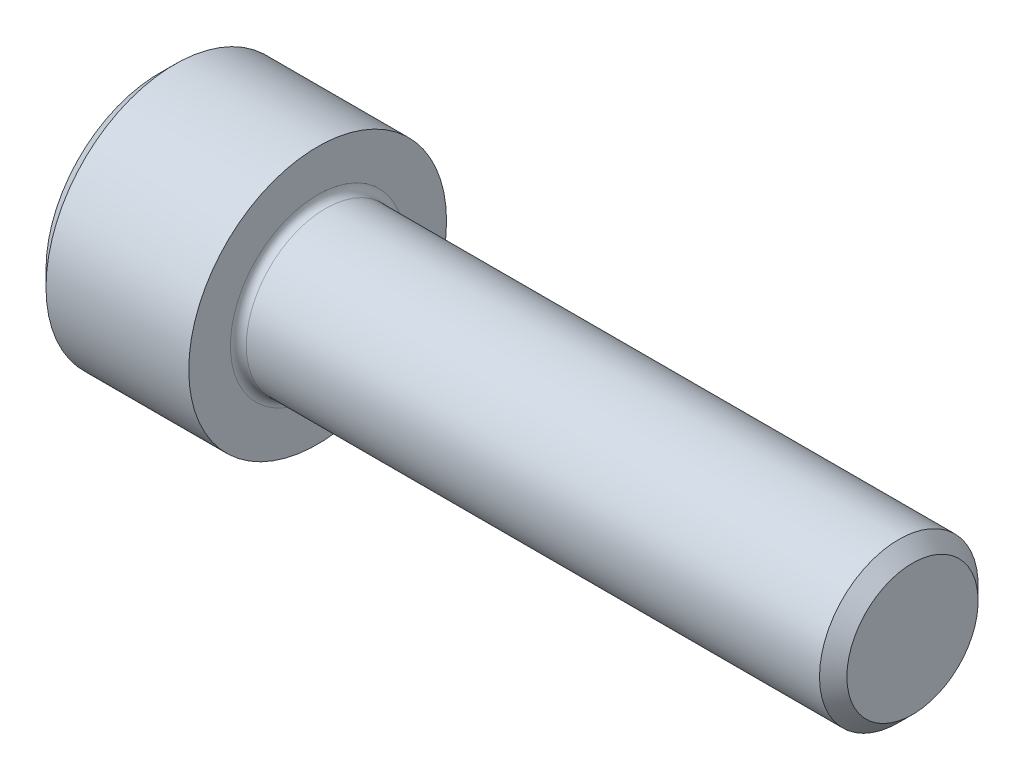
ISO-10303-21;
HEADER;
FILE_DESCRIPTION(('STEP AP214'),'2;1');
FILE_NAME('part.step','',(''),(''),'','','');
FILE_SCHEMA(('AUTOMOTIVE_DESIGN { 1 0 10303 214 1 1 1 1 }'));
ENDSEC;
DATA;
#1=APPLICATION_CONTEXT('core data for automotive mechanical design processes');
#2=APPLICATION_PROTOCOL_DEFINITION('international standard','automotive_design',2000,#1);
#3=PRODUCT_CONTEXT('',#1,'mechanical');
#4=PRODUCT('Part','Part','',(#3));
#5=PRODUCT_RELATED_PRODUCT_CATEGORY('part','',(#4));
#6=PRODUCT_DEFINITION_FORMATION('','',#4);
#7=PRODUCT_DEFINITION_CONTEXT('part definition',#1,'design');
#8=PRODUCT_DEFINITION('design','',#6,#7);
#9=PRODUCT_DEFINITION_SHAPE('','',#8);
#10=(LENGTH_UNIT() NAMED_UNIT(*) SI_UNIT(.MILLI.,.METRE.));
#11=(NAMED_UNIT(*) PLANE_ANGLE_UNIT() SI_UNIT($,.RADIAN.));
#12=(NAMED_UNIT(*) SI_UNIT($,.STERADIAN.) SOLID_ANGLE_UNIT());
#13=UNCERTAINTY_MEASURE_WITH_UNIT(LENGTH_MEASURE(1.E-05),#10,'distance_accuracy_value','');
#14=(GEOMETRIC_REPRESENTATION_CONTEXT(3) GLOBAL_UNCERTAINTY_ASSIGNED_CONTEXT((#13)) GLOBAL_UNIT_ASSIGNED_CONTEXT((#10,
#11,#12)) REPRESENTATION_CONTEXT('',''));
#15=CARTESIAN_POINT('',(0.,0.,0.));
#16=DIRECTION('',(0.,0.,1.));
#17=DIRECTION('',(1.,0.,0.));
#18=AXIS2_PLACEMENT_3D('',#15,#16,#17);
#19=CARTESIAN_POINT('',(0.,0.,0.));
#20=DIRECTION('',(-1.,0.,0.));
#21=DIRECTION('',(0.,0.,1.));
#22=AXIS2_PLACEMENT_3D('',#19,#20,#21);
#23=PLANE('',#22);
#24=DIRECTION('',(0.,-0.499999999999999,0.866025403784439));
#25=VECTOR('',#24,1.);
#26=CARTESIAN_POINT('',(0.,3.51894989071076,0.));
#27=LINE('',#26,#25);
#28=CARTESIAN_POINT('',(0.,3.51894989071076,0.));
#29=VERTEX_POINT('',#28);
#30=CARTESIAN_POINT('',(0.,1.75947494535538,3.0475));
#31=VERTEX_POINT('',#30);
#32=EDGE_CURVE('E370',#29,#31,#27,.T.);
#33=ORIENTED_EDGE('',*,*,#32,.T.);
#34=DIRECTION('',(0.,1.,0.));
#35=VECTOR('',#34,1.);
#36=CARTESIAN_POINT('',(0.,-1.75947494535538,3.0475));
#37=LINE('',#36,#35);
#38=CARTESIAN_POINT('',(0.,-1.75947494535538,3.0475));
#39=VERTEX_POINT('',#38);
#40=EDGE_CURVE('E126',#39,#31,#37,.T.);
#41=ORIENTED_EDGE('',*,*,#40,.F.);
#42=DIRECTION('',(0.,-0.500000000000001,-0.866025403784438));
#43=VECTOR('',#42,1.);
#44=CARTESIAN_POINT('',(0.,-1.75947494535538,3.0475));
#45=LINE('',#44,#43);
#46=CARTESIAN_POINT('',(0.,-3.51894989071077,0.));
#47=VERTEX_POINT('',#46);
#48=EDGE_CURVE('E373',#39,#47,#45,.T.);
#49=ORIENTED_EDGE('',*,*,#48,.T.);
#50=DIRECTION('',(0.,0.499999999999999,-0.866025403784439));
#51=VECTOR('',#50,1.);
#52=CARTESIAN_POINT('',(0.,-3.51894989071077,0.));
#53=LINE('',#52,#51);
#54=CARTESIAN_POINT('',(0.,-1.75947494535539,-3.0475));
#55=VERTEX_POINT('',#54);
#56=EDGE_CURVE('E376',#47,#55,#53,.T.);
#57=ORIENTED_EDGE('',*,*,#56,.T.);
#58=DIRECTION('',(0.,-1.,0.));
#59=VECTOR('',#58,1.);
#60=CARTESIAN_POINT('',(0.,1.75947494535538,-3.0475));
#61=LINE('',#60,#59);
#62=CARTESIAN_POINT('',(0.,1.75947494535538,-3.0475));
#63=VERTEX_POINT('',#62);
#64=EDGE_CURVE('E379',#63,#55,#61,.T.);
#65=ORIENTED_EDGE('',*,*,#64,.F.);
#66=DIRECTION('',(0.,-0.500000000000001,-0.866025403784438));
#67=VECTOR('',#66,1.);
#68=CARTESIAN_POINT('',(0.,3.51894989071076,0.));
#69=LINE('',#68,#67);
#70=EDGE_CURVE('E121',#29,#63,#69,.T.);
#71=ORIENTED_EDGE('',*,*,#70,.F.);
#72=EDGE_LOOP('',(#33,#41,#49,#57,#65,#71));
#73=FACE_BOUND('',#72,.T.);
#74=CARTESIAN_POINT('',(0.,0.,0.));
#75=DIRECTION('',(-1.,0.,0.));
#76=DIRECTION('',(0.,0.,1.));
#77=AXIS2_PLACEMENT_3D('',#74,#75,#76);
#78=CIRCLE('',#77,5.7);
#79=CARTESIAN_POINT('',(0.,0.,5.7));
#80=VERTEX_POINT('',#79);
#81=EDGE_CURVE('E137',#80,#80,#78,.T.);
#82=ORIENTED_EDGE('',*,*,#81,.T.);
#83=EDGE_LOOP('',(#82));
#84=FACE_BOUND('',#83,.T.);
#85=ADVANCED_FACE('F30',(#73,#84),#23,.T.);
#86=CARTESIAN_POINT('',(38.,3.3095,0.));
#87=DIRECTION('',(1.,0.,0.));
#88=DIRECTION('',(0.,0.,-1.));
#89=AXIS2_PLACEMENT_3D('',#86,#87,#88);
#90=PLANE('',#89);
#91=CARTESIAN_POINT('',(38.,0.,0.));
#92=DIRECTION('',(-1.,0.,0.));
#93=DIRECTION('',(0.,0.,1.));
#94=AXIS2_PLACEMENT_3D('',#91,#92,#93);
#95=CIRCLE('',#94,3.3095);
#96=CARTESIAN_POINT('',(38.,0.,3.3095));
#97=VERTEX_POINT('',#96);
#98=EDGE_CURVE('E150',#97,#97,#95,.T.);
#99=ORIENTED_EDGE('',*,*,#98,.F.);
#100=EDGE_LOOP('',(#99));
#101=FACE_BOUND('',#100,.T.);
#102=ADVANCED_FACE('F171',(#101),#90,.T.);
#103=CARTESIAN_POINT('',(38.,0.,0.));
#104=DIRECTION('',(-1.,0.,0.));
#105=DIRECTION('',(0.,0.,1.));
#106=AXIS2_PLACEMENT_3D('',#103,#104,#105);
#107=CONICAL_SURFACE('',#106,3.3095,0.785398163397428);
#108=CARTESIAN_POINT('',(37.3095,0.,0.));
#109=DIRECTION('',(-1.,0.,0.));
#110=DIRECTION('',(0.,0.,1.));
#111=AXIS2_PLACEMENT_3D('',#108,#109,#110);
#112=CIRCLE('',#111,3.99999999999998);
#113=CARTESIAN_POINT('',(37.3095,0.,3.99999999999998));
#114=VERTEX_POINT('',#113);
#115=EDGE_CURVE('E147',#114,#114,#112,.T.);
#116=ORIENTED_EDGE('',*,*,#115,.F.);
#117=EDGE_LOOP('',(#116));
#118=FACE_BOUND('',#117,.T.);
#119=ORIENTED_EDGE('',*,*,#98,.T.);
#120=EDGE_LOOP('',(#119));
#121=FACE_BOUND('',#120,.T.);
#122=ADVANCED_FACE('F177',(#118,#121),#107,.T.);
#123=CARTESIAN_POINT('',(-31.75,0.,0.));
#124=DIRECTION('',(-1.,0.,0.));
#125=DIRECTION('',(0.,0.,1.));
#126=AXIS2_PLACEMENT_3D('',#123,#124,#125);
#127=CYLINDRICAL_SURFACE('',#126,3.99999999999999);
#128=CARTESIAN_POINT('',(8.4,0.,0.));
#129=DIRECTION('',(1.,0.,0.));
#130=DIRECTION('',(0.,0.,-1.));
#131=AXIS2_PLACEMENT_3D('',#128,#129,#130);
#132=CIRCLE('',#131,3.99999999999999);
#133=CARTESIAN_POINT('',(8.4,0.,-3.99999999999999));
#134=VERTEX_POINT('',#133);
#135=EDGE_CURVE('E11',#134,#134,#132,.T.);
#136=ORIENTED_EDGE('',*,*,#135,.T.);
#137=EDGE_LOOP('',(#136));
#138=FACE_BOUND('',#137,.T.);
#139=ORIENTED_EDGE('',*,*,#115,.T.);
#140=EDGE_LOOP('',(#139));
#141=FACE_BOUND('',#140,.T.);
#142=ADVANCED_FACE('F188',(#138,#141),#127,.T.);
#143=CARTESIAN_POINT('',(8.,6.5,0.));
#144=DIRECTION('',(1.,0.,0.));
#145=DIRECTION('',(0.,0.,-1.));
#146=AXIS2_PLACEMENT_3D('',#143,#144,#145);
#147=PLANE('',#146);
#148=CARTESIAN_POINT('',(8.,0.,0.));
#149=DIRECTION('',(1.,0.,0.));
#150=DIRECTION('',(0.,0.,-1.));
#151=AXIS2_PLACEMENT_3D('',#148,#149,#150);
#152=CIRCLE('',#151,4.39999999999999);
#153=CARTESIAN_POINT('',(8.,0.,-4.39999999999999));
#154=VERTEX_POINT('',#153);
#155=EDGE_CURVE('E38',#154,#154,#152,.F.);
#156=ORIENTED_EDGE('',*,*,#155,.T.);
#157=EDGE_LOOP('',(#156));
#158=FACE_BOUND('',#157,.T.);
#159=CARTESIAN_POINT('',(8.,0.,0.));
#160=DIRECTION('',(-1.,0.,0.));
#161=DIRECTION('',(0.,0.,1.));
#162=AXIS2_PLACEMENT_3D('',#159,#160,#161);
#163=CIRCLE('',#162,6.5);
#164=CARTESIAN_POINT('',(8.,0.,6.5));
#165=VERTEX_POINT('',#164);
#166=EDGE_CURVE('E144',#165,#165,#163,.T.);
#167=ORIENTED_EDGE('',*,*,#166,.F.);
#168=EDGE_LOOP('',(#167));
#169=FACE_BOUND('',#168,.T.);
#170=ADVANCED_FACE('F155',(#158,#169),#147,.T.);
#171=CARTESIAN_POINT('',(-31.75,0.,0.));
#172=DIRECTION('',(-1.,0.,0.));
#173=DIRECTION('',(0.,0.,1.));
#174=AXIS2_PLACEMENT_3D('',#171,#172,#173);
#175=CYLINDRICAL_SURFACE('',#174,6.5);
#176=ORIENTED_EDGE('',*,*,#166,.T.);
#177=EDGE_LOOP('',(#176));
#178=FACE_BOUND('',#177,.T.);
#179=CARTESIAN_POINT('',(0.800000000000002,0.,0.));
#180=DIRECTION('',(-1.,0.,0.));
#181=DIRECTION('',(0.,0.,1.));
#182=AXIS2_PLACEMENT_3D('',#179,#180,#181);
#183=CIRCLE('',#182,6.5);
#184=CARTESIAN_POINT('',(0.800000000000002,0.,6.5));
#185=VERTEX_POINT('',#184);
#186=EDGE_CURVE('E141',#185,#185,#183,.T.);
#187=ORIENTED_EDGE('',*,*,#186,.F.);
#188=EDGE_LOOP('',(#187));
#189=FACE_BOUND('',#188,.T.);
#190=ADVANCED_FACE('F166',(#178,#189),#175,.T.);
#191=CARTESIAN_POINT('',(0.,0.,0.));
#192=DIRECTION('',(1.,0.,0.));
#193=DIRECTION('',(0.,0.,-1.));
#194=AXIS2_PLACEMENT_3D('',#191,#192,#193);
#195=CONICAL_SURFACE('',#194,5.7,0.785398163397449);
#196=ORIENTED_EDGE('',*,*,#186,.T.);
#197=EDGE_LOOP('',(#196));
#198=FACE_BOUND('',#197,.T.);
#199=ORIENTED_EDGE('',*,*,#81,.F.);
#200=EDGE_LOOP('',(#199));
#201=FACE_BOUND('',#200,.T.);
#202=ADVANCED_FACE('F159',(#198,#201),#195,.T.);
#203=CARTESIAN_POINT('',(8.4,0.,0.));
#204=DIRECTION('',(1.,0.,0.));
#205=DIRECTION('',(0.,0.,-1.));
#206=AXIS2_PLACEMENT_3D('',#203,#204,#205);
#207=TOROIDAL_SURFACE('',#206,4.39999999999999,0.4);
#208=ORIENTED_EDGE('',*,*,#135,.F.);
#209=EDGE_LOOP('',(#208));
#210=FACE_BOUND('',#209,.T.);
#211=ORIENTED_EDGE('',*,*,#155,.F.);
#212=EDGE_LOOP('',(#211));
#213=FACE_BOUND('',#212,.T.);
#214=ADVANCED_FACE('F32',(#210,#213),#207,.F.);
#215=CARTESIAN_POINT('',(4.,3.51894989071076,0.));
#216=DIRECTION('',(0.,-0.866025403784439,-0.499999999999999));
#217=DIRECTION('',(0.,0.499999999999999,-0.866025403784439));
#218=AXIS2_PLACEMENT_3D('',#215,#216,#217);
#219=PLANE('',#218);
#220=ORIENTED_EDGE('',*,*,#32,.F.);
#221=DIRECTION('',(-1.,0.,0.));
#222=VECTOR('',#221,1.);
#223=CARTESIAN_POINT('',(4.,3.51894989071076,0.));
#224=LINE('',#223,#222);
#225=CARTESIAN_POINT('',(4.,3.51894989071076,0.));
#226=VERTEX_POINT('',#225);
#227=EDGE_CURVE('E360',#226,#29,#224,.T.);
#228=ORIENTED_EDGE('',*,*,#227,.F.);
#229=DIRECTION('',(0.,-0.499999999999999,0.866025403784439));
#230=VECTOR('',#229,1.);
#231=CARTESIAN_POINT('',(4.,3.51894989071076,0.));
#232=LINE('',#231,#230);
#233=CARTESIAN_POINT('',(4.,2.63921241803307,1.52374999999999));
#234=VERTEX_POINT('',#233);
#235=EDGE_CURVE('E113',#226,#234,#232,.T.);
#236=ORIENTED_EDGE('',*,*,#235,.T.);
#237=CARTESIAN_POINT('',(4.,1.75947494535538,3.0475));
#238=VERTEX_POINT('',#237);
#239=EDGE_CURVE('E104',#234,#238,#232,.T.);
#240=ORIENTED_EDGE('',*,*,#239,.T.);
#241=DIRECTION('',(-1.,0.,0.));
#242=VECTOR('',#241,1.);
#243=CARTESIAN_POINT('',(4.,1.75947494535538,3.0475));
#244=LINE('',#243,#242);
#245=EDGE_CURVE('E118',#238,#31,#244,.T.);
#246=ORIENTED_EDGE('',*,*,#245,.T.);
#247=EDGE_LOOP('',(#220,#228,#236,#240,#246));
#248=FACE_BOUND('',#247,.T.);
#249=ADVANCED_FACE('F117',(#248),#219,.T.);
#250=CARTESIAN_POINT('',(4.,-1.75947494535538,3.0475));
#251=DIRECTION('',(0.,0.,1.));
#252=DIRECTION('',(0.,-1.,0.));
#253=AXIS2_PLACEMENT_3D('',#250,#251,#252);
#254=PLANE('',#253);
#255=ORIENTED_EDGE('',*,*,#40,.T.);
#256=ORIENTED_EDGE('',*,*,#245,.F.);
#257=DIRECTION('',(0.,1.,0.));
#258=VECTOR('',#257,1.);
#259=CARTESIAN_POINT('',(4.,-1.75947494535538,3.0475));
#260=LINE('',#259,#258);
#261=CARTESIAN_POINT('',(4.,0.,3.0475));
#262=VERTEX_POINT('',#261);
#263=EDGE_CURVE('E101',#262,#238,#260,.T.);
#264=ORIENTED_EDGE('',*,*,#263,.F.);
#265=CARTESIAN_POINT('',(4.,-1.75947494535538,3.0475));
#266=VERTEX_POINT('',#265);
#267=EDGE_CURVE('E112',#266,#262,#260,.T.);
#268=ORIENTED_EDGE('',*,*,#267,.F.);
#269=DIRECTION('',(-1.,0.,0.));
#270=VECTOR('',#269,1.);
#271=CARTESIAN_POINT('',(4.,-1.75947494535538,3.0475));
#272=LINE('',#271,#270);
#273=EDGE_CURVE('E128',#266,#39,#272,.T.);
#274=ORIENTED_EDGE('',*,*,#273,.T.);
#275=EDGE_LOOP('',(#255,#256,#264,#268,#274));
#276=FACE_BOUND('',#275,.T.);
#277=ADVANCED_FACE('F123',(#276),#254,.F.);
#278=CARTESIAN_POINT('',(4.,-1.75947494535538,3.0475));
#279=DIRECTION('',(0.,0.866025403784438,-0.500000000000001));
#280=DIRECTION('',(0.,0.500000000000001,0.866025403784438));
#281=AXIS2_PLACEMENT_3D('',#278,#279,#280);
#282=PLANE('',#281);
#283=ORIENTED_EDGE('',*,*,#48,.F.);
#284=ORIENTED_EDGE('',*,*,#273,.F.);
#285=DIRECTION('',(0.,-0.500000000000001,-0.866025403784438));
#286=VECTOR('',#285,1.);
#287=CARTESIAN_POINT('',(4.,-1.75947494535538,3.0475));
#288=LINE('',#287,#286);
#289=CARTESIAN_POINT('',(4.,-2.63921241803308,1.52375));
#290=VERTEX_POINT('',#289);
#291=EDGE_CURVE('E399',#266,#290,#288,.T.);
#292=ORIENTED_EDGE('',*,*,#291,.T.);
#293=CARTESIAN_POINT('',(4.,-3.51894989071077,0.));
#294=VERTEX_POINT('',#293);
#295=EDGE_CURVE('E388',#290,#294,#288,.T.);
#296=ORIENTED_EDGE('',*,*,#295,.T.);
#297=DIRECTION('',(-1.,0.,0.));
#298=VECTOR('',#297,1.);
#299=CARTESIAN_POINT('',(4.,-3.51894989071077,0.));
#300=LINE('',#299,#298);
#301=EDGE_CURVE('E133',#294,#47,#300,.T.);
#302=ORIENTED_EDGE('',*,*,#301,.T.);
#303=EDGE_LOOP('',(#283,#284,#292,#296,#302));
#304=FACE_BOUND('',#303,.T.);
#305=ADVANCED_FACE('F251',(#304),#282,.T.);
#306=CARTESIAN_POINT('',(4.,-3.51894989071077,0.));
#307=DIRECTION('',(0.,0.86602540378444,0.499999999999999));
#308=DIRECTION('',(0.,-0.499999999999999,0.866025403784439));
#309=AXIS2_PLACEMENT_3D('',#306,#307,#308);
#310=PLANE('',#309);
#311=ORIENTED_EDGE('',*,*,#56,.F.);
#312=ORIENTED_EDGE('',*,*,#301,.F.);
#313=DIRECTION('',(0.,0.499999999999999,-0.866025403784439));
#314=VECTOR('',#313,1.);
#315=CARTESIAN_POINT('',(4.,-3.51894989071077,0.));
#316=LINE('',#315,#314);
#317=CARTESIAN_POINT('',(4.,-2.63921241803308,-1.52375));
#318=VERTEX_POINT('',#317);
#319=EDGE_CURVE('E366',#294,#318,#316,.T.);
#320=ORIENTED_EDGE('',*,*,#319,.T.);
#321=CARTESIAN_POINT('',(4.,-1.75947494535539,-3.0475));
#322=VERTEX_POINT('',#321);
#323=EDGE_CURVE('E398',#318,#322,#316,.T.);
#324=ORIENTED_EDGE('',*,*,#323,.T.);
#325=DIRECTION('',(-1.,0.,0.));
#326=VECTOR('',#325,1.);
#327=CARTESIAN_POINT('',(4.,-1.75947494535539,-3.0475));
#328=LINE('',#327,#326);
#329=EDGE_CURVE('E359',#322,#55,#328,.T.);
#330=ORIENTED_EDGE('',*,*,#329,.T.);
#331=EDGE_LOOP('',(#311,#312,#320,#324,#330));
#332=FACE_BOUND('',#331,.T.);
#333=ADVANCED_FACE('F259',(#332),#310,.T.);
#334=CARTESIAN_POINT('',(4.,1.75947494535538,-3.0475));
#335=DIRECTION('',(0.,0.,-1.));
#336=DIRECTION('',(0.,1.,0.));
#337=AXIS2_PLACEMENT_3D('',#334,#335,#336);
#338=PLANE('',#337);
#339=ORIENTED_EDGE('',*,*,#64,.T.);
#340=ORIENTED_EDGE('',*,*,#329,.F.);
#341=DIRECTION('',(0.,-1.,0.));
#342=VECTOR('',#341,1.);
#343=CARTESIAN_POINT('',(4.,1.75947494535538,-3.0475));
#344=LINE('',#343,#342);
#345=CARTESIAN_POINT('',(4.,0.,-3.0475));
#346=VERTEX_POINT('',#345);
#347=EDGE_CURVE('E363',#346,#322,#344,.T.);
#348=ORIENTED_EDGE('',*,*,#347,.F.);
#349=CARTESIAN_POINT('',(4.,1.75947494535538,-3.0475));
#350=VERTEX_POINT('',#349);
#351=EDGE_CURVE('E45',#350,#346,#344,.T.);
#352=ORIENTED_EDGE('',*,*,#351,.F.);
#353=DIRECTION('',(-1.,0.,0.));
#354=VECTOR('',#353,1.);
#355=CARTESIAN_POINT('',(4.,1.75947494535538,-3.0475));
#356=LINE('',#355,#354);
#357=EDGE_CURVE('E356',#350,#63,#356,.T.);
#358=ORIENTED_EDGE('',*,*,#357,.T.);
#359=EDGE_LOOP('',(#339,#340,#348,#352,#358));
#360=FACE_BOUND('',#359,.T.);
#361=ADVANCED_FACE('F268',(#360),#338,.F.);
#362=CARTESIAN_POINT('',(4.,3.51894989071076,0.));
#363=DIRECTION('',(0.,0.866025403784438,-0.500000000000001));
#364=DIRECTION('',(0.,0.500000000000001,0.866025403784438));
#365=AXIS2_PLACEMENT_3D('',#362,#363,#364);
#366=PLANE('',#365);
#367=ORIENTED_EDGE('',*,*,#70,.T.);
#368=ORIENTED_EDGE('',*,*,#357,.F.);
#369=DIRECTION('',(0.,-0.500000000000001,-0.866025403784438));
#370=VECTOR('',#369,1.);
#371=CARTESIAN_POINT('',(4.,3.51894989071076,0.));
#372=LINE('',#371,#370);
#373=CARTESIAN_POINT('',(4.,2.63921241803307,-1.52375));
#374=VERTEX_POINT('',#373);
#375=EDGE_CURVE('E346',#374,#350,#372,.T.);
#376=ORIENTED_EDGE('',*,*,#375,.F.);
#377=EDGE_CURVE('E352',#226,#374,#372,.T.);
#378=ORIENTED_EDGE('',*,*,#377,.F.);
#379=ORIENTED_EDGE('',*,*,#227,.T.);
#380=EDGE_LOOP('',(#367,#368,#376,#378,#379));
#381=FACE_BOUND('',#380,.T.);
#382=ADVANCED_FACE('F277',(#381),#366,.F.);
#383=CARTESIAN_POINT('',(4.,5.27842483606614,-3.04750000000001));
#384=DIRECTION('',(1.,0.,0.));
#385=DIRECTION('',(0.,0.,-1.));
#386=AXIS2_PLACEMENT_3D('',#383,#384,#385);
#387=PLANE('',#386);
#388=ORIENTED_EDGE('',*,*,#347,.T.);
#389=ORIENTED_EDGE('',*,*,#323,.F.);
#390=CARTESIAN_POINT('',(4.,0.,0.));
#391=DIRECTION('',(-1.,0.,0.));
#392=DIRECTION('',(0.,0.,1.));
#393=AXIS2_PLACEMENT_3D('',#390,#391,#392);
#394=CIRCLE('',#393,3.0475);
#395=EDGE_CURVE('E394',#346,#318,#394,.T.);
#396=ORIENTED_EDGE('',*,*,#395,.F.);
#397=EDGE_LOOP('',(#388,#389,#396));
#398=FACE_BOUND('',#397,.T.);
#399=ADVANCED_FACE('F286',(#398),#387,.F.);
#400=ORIENTED_EDGE('',*,*,#319,.F.);
#401=ORIENTED_EDGE('',*,*,#295,.F.);
#402=EDGE_CURVE('E131',#318,#290,#394,.T.);
#403=ORIENTED_EDGE('',*,*,#402,.F.);
#404=EDGE_LOOP('',(#400,#401,#403));
#405=FACE_BOUND('',#404,.T.);
#406=ADVANCED_FACE('F295',(#405),#387,.F.);
#407=ORIENTED_EDGE('',*,*,#291,.F.);
#408=ORIENTED_EDGE('',*,*,#267,.T.);
#409=EDGE_CURVE('E127',#290,#262,#394,.T.);
#410=ORIENTED_EDGE('',*,*,#409,.F.);
#411=EDGE_LOOP('',(#407,#408,#410));
#412=FACE_BOUND('',#411,.T.);
#413=ADVANCED_FACE('F304',(#412),#387,.F.);
#414=ORIENTED_EDGE('',*,*,#263,.T.);
#415=ORIENTED_EDGE('',*,*,#239,.F.);
#416=EDGE_CURVE('E107',#262,#234,#394,.T.);
#417=ORIENTED_EDGE('',*,*,#416,.F.);
#418=EDGE_LOOP('',(#414,#415,#417));
#419=FACE_BOUND('',#418,.T.);
#420=ADVANCED_FACE('F103',(#419),#387,.F.);
#421=ORIENTED_EDGE('',*,*,#235,.F.);
#422=ORIENTED_EDGE('',*,*,#377,.T.);
#423=EDGE_CURVE('E138',#234,#374,#394,.T.);
#424=ORIENTED_EDGE('',*,*,#423,.F.);
#425=EDGE_LOOP('',(#421,#422,#424));
#426=FACE_BOUND('',#425,.T.);
#427=ADVANCED_FACE('F319',(#426),#387,.F.);
#428=ORIENTED_EDGE('',*,*,#375,.T.);
#429=ORIENTED_EDGE('',*,*,#351,.T.);
#430=EDGE_CURVE('E349',#374,#346,#394,.T.);
#431=ORIENTED_EDGE('',*,*,#430,.F.);
#432=EDGE_LOOP('',(#428,#429,#431));
#433=FACE_BOUND('',#432,.T.);
#434=ADVANCED_FACE('F234',(#433),#387,.F.);
#435=CARTESIAN_POINT('',(4.,0.,0.));
#436=DIRECTION('',(-1.,0.,0.));
#437=DIRECTION('',(0.,0.,1.));
#438=AXIS2_PLACEMENT_3D('',#435,#436,#437);
#439=CONICAL_SURFACE('',#438,3.0475,1.04719755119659);
#440=CARTESIAN_POINT('',(5.75947494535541,0.,0.));
#441=VERTEX_POINT('',#440);
#442=VERTEX_LOOP('',#441);
#443=FACE_BOUND('',#442,.T.);
#444=ORIENTED_EDGE('',*,*,#416,.T.);
#445=ORIENTED_EDGE('',*,*,#423,.T.);
#446=ORIENTED_EDGE('',*,*,#430,.T.);
#447=ORIENTED_EDGE('',*,*,#395,.T.);
#448=ORIENTED_EDGE('',*,*,#402,.T.);
#449=ORIENTED_EDGE('',*,*,#409,.T.);
#450=EDGE_LOOP('',(#444,#445,#446,#447,#448,#449));
#451=FACE_BOUND('',#450,.T.);
#452=ADVANCED_FACE('F181',(#443,#451),#439,.F.);
#453=CLOSED_SHELL('',(#85,#102,#122,#142,#170,#190,#202,#214,#249,#277,#305,#333,#361,#382,#399,
#406,#413,#420,#427,#434,#452));
#454=MANIFOLD_SOLID_BREP('B2',#453);
#455=ADVANCED_BREP_SHAPE_REPRESENTATION('',(#18,#454),#14);
#456=SHAPE_DEFINITION_REPRESENTATION(#9,#455);
ENDSEC;
END-ISO-10303-21;
